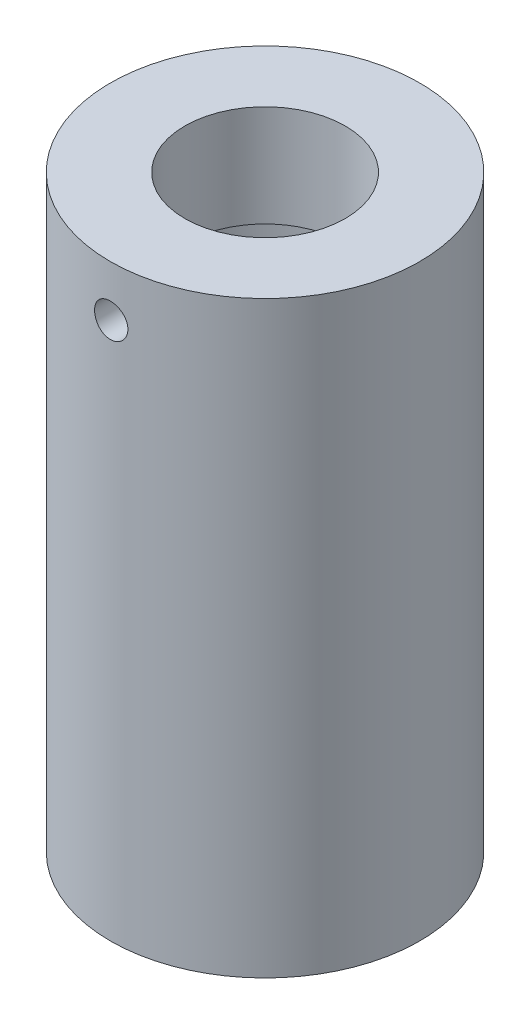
ISO-10303-21;
HEADER;
FILE_DESCRIPTION(('STEP AP214'),'2;1');
FILE_NAME('part.step','',(''),(''),'','','');
FILE_SCHEMA(('AUTOMOTIVE_DESIGN { 1 0 10303 214 1 1 1 1 }'));
ENDSEC;
DATA;
#1=APPLICATION_CONTEXT('core data for automotive mechanical design processes');
#2=APPLICATION_PROTOCOL_DEFINITION('international standard','automotive_design',2000,#1);
#3=PRODUCT_CONTEXT('',#1,'mechanical');
#4=PRODUCT('Part','Part','',(#3));
#5=PRODUCT_RELATED_PRODUCT_CATEGORY('part','',(#4));
#6=PRODUCT_DEFINITION_FORMATION('','',#4);
#7=PRODUCT_DEFINITION_CONTEXT('part definition',#1,'design');
#8=PRODUCT_DEFINITION('design','',#6,#7);
#9=PRODUCT_DEFINITION_SHAPE('','',#8);
#10=(LENGTH_UNIT() NAMED_UNIT(*) SI_UNIT(.MILLI.,.METRE.));
#11=(NAMED_UNIT(*) PLANE_ANGLE_UNIT() SI_UNIT($,.RADIAN.));
#12=(NAMED_UNIT(*) SI_UNIT($,.STERADIAN.) SOLID_ANGLE_UNIT());
#13=UNCERTAINTY_MEASURE_WITH_UNIT(LENGTH_MEASURE(1.E-05),#10,'distance_accuracy_value','');
#14=(GEOMETRIC_REPRESENTATION_CONTEXT(3) GLOBAL_UNCERTAINTY_ASSIGNED_CONTEXT((#13)) GLOBAL_UNIT_ASSIGNED_CONTEXT((#10,
#11,#12)) REPRESENTATION_CONTEXT('',''));
#15=CARTESIAN_POINT('',(0.,0.,0.));
#16=DIRECTION('',(0.,0.,1.));
#17=DIRECTION('',(1.,0.,0.));
#18=AXIS2_PLACEMENT_3D('',#15,#16,#17);
#19=CARTESIAN_POINT('',(0.,93.98,0.));
#20=DIRECTION('',(0.,1.,0.));
#21=DIRECTION('',(0.,0.,1.));
#22=AXIS2_PLACEMENT_3D('',#19,#20,#21);
#23=CYLINDRICAL_SURFACE('',#22,18.8595);
#24=CARTESIAN_POINT('',(0.,71.7296,0.));
#25=DIRECTION('',(0.,1.,0.));
#26=DIRECTION('',(0.,0.,1.));
#27=AXIS2_PLACEMENT_3D('',#24,#25,#26);
#28=CIRCLE('',#27,18.8595);
#29=CARTESIAN_POINT('',(0.,71.7296,18.8595));
#30=VERTEX_POINT('',#29);
#31=EDGE_CURVE('E10',#30,#30,#28,.T.);
#32=ORIENTED_EDGE('',*,*,#31,.F.);
#33=EDGE_LOOP('',(#32));
#34=FACE_BOUND('',#33,.T.);
#35=CARTESIAN_POINT('',(0.,0.,0.));
#36=DIRECTION('',(0.,1.,0.));
#37=DIRECTION('',(0.,0.,1.));
#38=AXIS2_PLACEMENT_3D('',#35,#36,#37);
#39=CIRCLE('',#38,18.8595);
#40=CARTESIAN_POINT('',(0.,0.,18.8595));
#41=VERTEX_POINT('',#40);
#42=EDGE_CURVE('E35',#41,#41,#39,.T.);
#43=ORIENTED_EDGE('',*,*,#42,.T.);
#44=EDGE_LOOP('',(#43));
#45=FACE_BOUND('',#44,.T.);
#46=CARTESIAN_POINT('',(-2.032,65.532,18.7497124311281));
#47=CARTESIAN_POINT('',(-2.03199509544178,65.418217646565,18.7497138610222));
#48=CARTESIAN_POINT('',(-2.02241088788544,65.3043612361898,18.7507593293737));
#49=CARTESIAN_POINT('',(-1.98432430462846,65.0798085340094,18.7548273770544));
#50=CARTESIAN_POINT('',(-1.95580138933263,64.9691158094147,18.7578521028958));
#51=CARTESIAN_POINT('',(-1.88068058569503,64.7541746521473,18.7655321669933));
#52=CARTESIAN_POINT('',(-1.83409402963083,64.6499222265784,18.7701864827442));
#53=CARTESIAN_POINT('',(-1.72419089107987,64.4507376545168,18.7806000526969));
#54=CARTESIAN_POINT('',(-1.66087749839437,64.3558037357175,18.7863590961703));
#55=CARTESIAN_POINT('',(-1.51903275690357,64.1775309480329,18.7983602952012));
#56=CARTESIAN_POINT('',(-1.44044540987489,64.0942367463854,18.8046041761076));
#57=CARTESIAN_POINT('',(-1.27040356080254,63.9419928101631,18.8168559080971));
#58=CARTESIAN_POINT('',(-1.17894845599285,63.8730437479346,18.8228637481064));
#59=CARTESIAN_POINT('',(-0.985491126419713,63.7512909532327,18.8339837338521));
#60=CARTESIAN_POINT('',(-0.883463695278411,63.6985270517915,18.8390936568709));
#61=CARTESIAN_POINT('',(-0.671932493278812,63.6108972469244,18.8478232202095));
#62=CARTESIAN_POINT('',(-0.56242893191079,63.5760308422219,18.8514429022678));
#63=CARTESIAN_POINT('',(-0.339507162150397,63.5253175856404,18.8567720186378));
#64=CARTESIAN_POINT('',(-0.226105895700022,63.509397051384,18.8584888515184));
#65=CARTESIAN_POINT('',(0.00177107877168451,63.496799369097,18.8598440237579));
#66=CARTESIAN_POINT('',(0.116246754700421,63.5001216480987,18.8594824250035));
#67=CARTESIAN_POINT('',(0.342522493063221,63.5258556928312,18.8567275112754));
#68=CARTESIAN_POINT('',(0.454331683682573,63.5481882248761,18.8543426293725));
#69=CARTESIAN_POINT('',(0.672605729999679,63.6111852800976,18.8478187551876));
#70=CARTESIAN_POINT('',(0.779070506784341,63.6518500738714,18.8436797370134));
#71=CARTESIAN_POINT('',(0.983882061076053,63.7504434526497,18.8340983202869));
#72=CARTESIAN_POINT('',(1.08221193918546,63.8084068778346,18.8286532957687));
#73=CARTESIAN_POINT('',(1.26777808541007,63.9399268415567,18.8170703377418));
#74=CARTESIAN_POINT('',(1.3550139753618,64.0134839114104,18.8109323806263));
#75=CARTESIAN_POINT('',(1.5163803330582,64.1745482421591,18.7986150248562));
#76=CARTESIAN_POINT('',(1.59044197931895,64.2621244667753,18.7924355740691));
#77=CARTESIAN_POINT('',(1.72282410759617,64.4485026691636,18.7807627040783));
#78=CARTESIAN_POINT('',(1.78114456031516,64.5473046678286,18.7752692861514));
#79=CARTESIAN_POINT('',(1.88038967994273,64.7533850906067,18.7655901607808));
#80=CARTESIAN_POINT('',(1.92130973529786,64.8606657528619,18.7614048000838));
#81=CARTESIAN_POINT('',(1.98453615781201,65.080630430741,18.7548227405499));
#82=CARTESIAN_POINT('',(2.00684318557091,65.1933142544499,18.7524259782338));
#83=CARTESIAN_POINT('',(2.03212106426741,65.4202813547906,18.7497036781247));
#84=CARTESIAN_POINT('',(2.03518835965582,65.5345537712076,18.749367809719));
#85=CARTESIAN_POINT('',(2.02215332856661,65.761985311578,18.7507780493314));
#86=CARTESIAN_POINT('',(2.00605130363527,65.8751444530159,18.7525241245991));
#87=CARTESIAN_POINT('',(1.95521554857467,66.0968538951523,18.7578921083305));
#88=CARTESIAN_POINT('',(1.92052773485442,66.2054148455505,18.7615093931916));
#89=CARTESIAN_POINT('',(1.83355204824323,66.4151779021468,18.7702084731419));
#90=CARTESIAN_POINT('',(1.78126370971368,66.5163798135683,18.7752903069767));
#91=CARTESIAN_POINT('',(1.66033092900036,66.7089907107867,18.786370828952));
#92=CARTESIAN_POINT('',(1.59162276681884,66.8003594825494,18.7923730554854));
#93=CARTESIAN_POINT('',(1.43989168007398,66.970301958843,18.8046066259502));
#94=CARTESIAN_POINT('',(1.35686834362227,67.0488752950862,18.8108379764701));
#95=CARTESIAN_POINT('',(1.17844439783,67.1913308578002,18.8228590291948));
#96=CARTESIAN_POINT('',(1.0829932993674,67.2551500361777,18.8286467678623));
#97=CARTESIAN_POINT('',(0.882671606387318,67.3658511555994,18.8390996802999));
#98=CARTESIAN_POINT('',(0.777801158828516,67.4127333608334,18.8437648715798));
#99=CARTESIAN_POINT('',(0.561834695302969,67.4881236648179,18.8514382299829));
#100=CARTESIAN_POINT('',(0.450751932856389,67.5166693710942,18.8544497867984));
#101=CARTESIAN_POINT('',(0.225335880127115,67.5546990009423,18.858490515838));
#102=CARTESIAN_POINT('',(0.111002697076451,67.5641835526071,18.8595197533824));
#103=CARTESIAN_POINT('',(-0.117050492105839,67.5638119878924,18.8594797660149));
#104=CARTESIAN_POINT('',(-0.230770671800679,67.5540535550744,18.858421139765));
#105=CARTESIAN_POINT('',(-0.454945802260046,67.515678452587,18.8543453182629));
#106=CARTESIAN_POINT('',(-0.5654007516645,67.4870617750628,18.8513281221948));
#107=CARTESIAN_POINT('',(-0.779905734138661,67.4118106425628,18.8436730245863));
#108=CARTESIAN_POINT('',(-0.883956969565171,67.3651795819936,18.8390354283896));
#109=CARTESIAN_POINT('',(-1.08277156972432,67.2552336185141,18.8286554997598));
#110=CARTESIAN_POINT('',(-1.17753494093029,67.1919187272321,18.8229131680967));
#111=CARTESIAN_POINT('',(-1.3555841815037,67.0500371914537,18.8109315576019));
#112=CARTESIAN_POINT('',(-1.4388119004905,66.9713977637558,18.8046899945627));
#113=CARTESIAN_POINT('',(-1.5909313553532,66.8012461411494,18.7924324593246));
#114=CARTESIAN_POINT('',(-1.65981966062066,66.7097308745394,18.7864165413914));
#115=CARTESIAN_POINT('',(-1.78146770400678,66.5161288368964,18.7752727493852));
#116=CARTESIAN_POINT('',(-1.8341799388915,66.4140120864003,18.7701475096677));
#117=CARTESIAN_POINT('',(-1.92163712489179,66.2023842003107,18.7613965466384));
#118=CARTESIAN_POINT('',(-1.95640213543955,66.0928814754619,18.7577691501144));
#119=CARTESIAN_POINT('',(-1.99840706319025,65.9076444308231,18.7533297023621));
#120=CARTESIAN_POINT('',(-2.01098694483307,65.833090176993,18.7519797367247));
#121=CARTESIAN_POINT('',(-2.02778501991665,65.683034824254,18.7501706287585));
#122=CARTESIAN_POINT('',(-2.03200325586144,65.60753373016,18.7497114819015));
#123=CARTESIAN_POINT('',(-2.032,65.532,18.7497124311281));
#124=B_SPLINE_CURVE_WITH_KNOTS('',3,(#46,#47,#48,#49,#50,#51,#52,#53,#54,#55,#56,#57,#58,#59,
#60,#61,#62,#63,#64,#65,#66,#67,#68,#69,#70,#71,#72,#73,#74,#75,#76,#77,#78,#79,#80,#81,#82,#83,
#84,#85,#86,#87,#88,#89,#90,#91,#92,#93,#94,#95,#96,#97,#98,#99,#100,#101,#102,#103,#104,#105,
#106,#107,#108,#109,#110,#111,#112,#113,#114,#115,#116,#117,#118,#119,#120,#121,#122,#123),
.UNSPECIFIED.,.T.,.F.,(4,2,2,2,2,2,2,2,2,2,2,2,2,2,2,2,2,2,2,2,2,2,2,2,2,2,2,2,2,2,2,2,2,2,2,2,
2,2,4),(0.,0.341071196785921,0.682512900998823,1.02374074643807,1.36490356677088,
1.70734161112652,2.04979570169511,2.39308591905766,2.73636652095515,3.0783076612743,
3.42023862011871,3.7607513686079,4.10126914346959,4.4424774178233,4.78369731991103,
5.12665048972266,5.46960429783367,5.81264894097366,6.15568140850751,6.49699294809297,
6.83829911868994,7.17876595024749,7.51924178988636,7.8610609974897,8.20289004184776,
8.54615386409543,8.88941233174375,9.23196452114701,9.57450542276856,9.91531195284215,
10.2561186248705,10.5968611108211,10.9376033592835,11.280005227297,11.6224889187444,
11.9659689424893,12.3090642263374,12.5354834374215,12.7619014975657),.UNSPECIFIED.);
#125=CARTESIAN_POINT('',(-2.032,65.532,18.7497124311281));
#126=VERTEX_POINT('',#125);
#127=EDGE_CURVE('E54',#126,#126,#124,.T.);
#128=ORIENTED_EDGE('',*,*,#127,.F.);
#129=EDGE_LOOP('',(#128));
#130=FACE_BOUND('',#129,.T.);
#131=ADVANCED_FACE('F28',(#34,#45,#130),#23,.T.);
#132=CARTESIAN_POINT('',(0.,93.98,0.));
#133=DIRECTION('',(0.,1.,0.));
#134=DIRECTION('',(0.,0.,1.));
#135=AXIS2_PLACEMENT_3D('',#132,#133,#134);
#136=CYLINDRICAL_SURFACE('',#135,9.779);
#137=CARTESIAN_POINT('',(0.,59.3598,0.));
#138=DIRECTION('',(0.,1.,0.));
#139=DIRECTION('',(0.,0.,1.));
#140=AXIS2_PLACEMENT_3D('',#137,#138,#139);
#141=CIRCLE('',#140,9.77899999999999);
#142=CARTESIAN_POINT('',(0.,59.3598,9.77899999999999));
#143=VERTEX_POINT('',#142);
#144=EDGE_CURVE('E48',#143,#143,#141,.T.);
#145=ORIENTED_EDGE('',*,*,#144,.F.);
#146=EDGE_LOOP('',(#145));
#147=FACE_BOUND('',#146,.T.);
#148=CARTESIAN_POINT('',(0.,71.7296,0.));
#149=DIRECTION('',(0.,1.,0.));
#150=DIRECTION('',(0.,0.,1.));
#151=AXIS2_PLACEMENT_3D('',#148,#149,#150);
#152=CIRCLE('',#151,9.779);
#153=CARTESIAN_POINT('',(0.,71.7296,9.779));
#154=VERTEX_POINT('',#153);
#155=EDGE_CURVE('E51',#154,#154,#152,.T.);
#156=ORIENTED_EDGE('',*,*,#155,.T.);
#157=EDGE_LOOP('',(#156));
#158=FACE_BOUND('',#157,.T.);
#159=CARTESIAN_POINT('',(-2.032,65.532,9.56555366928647));
#160=CARTESIAN_POINT('',(-2.03199594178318,65.6448083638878,9.56555593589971));
#161=CARTESIAN_POINT('',(-2.02257408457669,65.7576668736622,9.56757093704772));
#162=CARTESIAN_POINT('',(-1.98517097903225,65.980184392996,9.57540018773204));
#163=CARTESIAN_POINT('',(-1.95717546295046,66.0898408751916,9.58121735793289));
#164=CARTESIAN_POINT('',(-1.88353631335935,66.3027030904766,9.59596431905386));
#165=CARTESIAN_POINT('',(-1.83791096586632,66.4059153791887,9.60489088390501));
#166=CARTESIAN_POINT('',(-1.73035830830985,66.6032196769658,9.62484698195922));
#167=CARTESIAN_POINT('',(-1.66843167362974,66.6973120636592,9.63587642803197));
#168=CARTESIAN_POINT('',(-1.5290272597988,66.8751445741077,9.65898353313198));
#169=CARTESIAN_POINT('',(-1.4513481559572,66.9587253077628,9.67107347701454));
#170=CARTESIAN_POINT('',(-1.28307866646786,67.1117686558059,9.69483145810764));
#171=CARTESIAN_POINT('',(-1.19248733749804,67.1812302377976,9.70649946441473));
#172=CARTESIAN_POINT('',(-0.999904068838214,67.3046869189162,9.72823193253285));
#173=CARTESIAN_POINT('',(-0.897812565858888,67.3585297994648,9.73828021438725));
#174=CARTESIAN_POINT('',(-0.685787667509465,67.4482373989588,9.75550275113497));
#175=CARTESIAN_POINT('',(-0.575855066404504,67.4841039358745,9.76267729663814));
#176=CARTESIAN_POINT('',(-0.352924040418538,67.5363424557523,9.77325718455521));
#177=CARTESIAN_POINT('',(-0.239991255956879,67.5529838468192,9.77671456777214));
#178=CARTESIAN_POINT('',(-0.0128873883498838,67.5671409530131,9.77965054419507));
#179=CARTESIAN_POINT('',(0.101283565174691,67.5646586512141,9.77912954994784));
#180=CARTESIAN_POINT('',(0.325769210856,67.5408416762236,9.77420757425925));
#181=CARTESIAN_POINT('',(0.436116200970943,67.5197972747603,9.76986633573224));
#182=CARTESIAN_POINT('',(0.651677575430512,67.4599147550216,9.75785930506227));
#183=CARTESIAN_POINT('',(0.756891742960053,67.4210758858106,9.75019337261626));
#184=CARTESIAN_POINT('',(0.960019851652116,67.3264429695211,9.73230080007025));
#185=CARTESIAN_POINT('',(1.05787996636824,67.2705367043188,9.72205729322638));
#186=CARTESIAN_POINT('',(1.2429366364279,67.1434392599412,9.70013637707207));
#187=CARTESIAN_POINT('',(1.33013187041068,67.0722461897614,9.68845879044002));
#188=CARTESIAN_POINT('',(1.49310784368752,66.9150084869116,9.66469816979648));
#189=CARTESIAN_POINT('',(1.56864316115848,66.8287097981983,9.65261164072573));
#190=CARTESIAN_POINT('',(1.70421173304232,66.6445466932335,9.62960256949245));
#191=CARTESIAN_POINT('',(1.7642446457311,66.5466820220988,9.61868005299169));
#192=CARTESIAN_POINT('',(1.8671987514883,66.3417945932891,9.59922781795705));
#193=CARTESIAN_POINT('',(1.91007752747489,66.2347499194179,9.59070404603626));
#194=CARTESIAN_POINT('',(1.97716705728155,66.0147565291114,9.5770995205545));
#195=CARTESIAN_POINT('',(2.00138045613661,65.9018086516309,9.57201827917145));
#196=CARTESIAN_POINT('',(2.03007949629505,65.6754467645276,9.5659725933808));
#197=CARTESIAN_POINT('',(2.03492073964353,65.56207977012,9.56493395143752));
#198=CARTESIAN_POINT('',(2.02569731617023,65.3361583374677,9.56689149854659));
#199=CARTESIAN_POINT('',(2.01163381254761,65.2236038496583,9.5698874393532));
#200=CARTESIAN_POINT('',(1.96530748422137,65.0037150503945,9.57950686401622));
#201=CARTESIAN_POINT('',(1.93323703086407,64.8963383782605,9.58609198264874));
#202=CARTESIAN_POINT('',(1.85201390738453,64.6884823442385,9.60211375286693));
#203=CARTESIAN_POINT('',(1.80285973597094,64.5880035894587,9.61155065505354));
#204=CARTESIAN_POINT('',(1.68806828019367,64.3952465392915,9.63237789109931));
#205=CARTESIAN_POINT('',(1.62220988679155,64.3031027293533,9.64379372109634));
#206=CARTESIAN_POINT('',(1.47617198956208,64.1310444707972,9.66722369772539));
#207=CARTESIAN_POINT('',(1.39599088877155,64.051131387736,9.67923791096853));
#208=CARTESIAN_POINT('',(1.22198203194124,63.9044418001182,9.70275330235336));
#209=CARTESIAN_POINT('',(1.12794902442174,63.8379065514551,9.71424258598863));
#210=CARTESIAN_POINT('',(0.929833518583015,63.7215782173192,9.73520200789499));
#211=CARTESIAN_POINT('',(0.825751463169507,63.6717843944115,9.74467223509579));
#212=CARTESIAN_POINT('',(0.611105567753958,63.5906977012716,9.7604759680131));
#213=CARTESIAN_POINT('',(0.500584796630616,63.5592946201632,9.7668281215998));
#214=CARTESIAN_POINT('',(0.275690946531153,63.51553353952,9.77576024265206));
#215=CARTESIAN_POINT('',(0.161318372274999,63.5031730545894,9.77834070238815));
#216=CARTESIAN_POINT('',(-0.0657338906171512,63.4979506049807,9.77942583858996));
#217=CARTESIAN_POINT('',(-0.178405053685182,63.5047269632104,9.77800611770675));
#218=CARTESIAN_POINT('',(-0.400965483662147,63.53678303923,9.77141059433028));
#219=CARTESIAN_POINT('',(-0.510854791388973,63.5620624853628,9.76623484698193));
#220=CARTESIAN_POINT('',(-0.724484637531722,63.6302411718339,9.75271237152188));
#221=CARTESIAN_POINT('',(-0.828240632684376,63.6730937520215,9.74437404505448));
#222=CARTESIAN_POINT('',(-1.02714020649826,63.7751548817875,9.72542117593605));
#223=CARTESIAN_POINT('',(-1.1222830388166,63.834364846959,9.71480643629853));
#224=CARTESIAN_POINT('',(-1.30303423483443,63.9686635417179,9.69223359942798));
#225=CARTESIAN_POINT('',(-1.38844916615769,64.0440092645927,9.68025543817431));
#226=CARTESIAN_POINT('',(-1.54554715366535,64.2079164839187,9.65642032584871));
#227=CARTESIAN_POINT('',(-1.61722693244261,64.2964811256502,9.64456340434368));
#228=CARTESIAN_POINT('',(-1.74562860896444,64.4855678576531,9.62215835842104));
#229=CARTESIAN_POINT('',(-1.80216394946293,64.5862187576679,9.61162733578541));
#230=CARTESIAN_POINT('',(-1.89742884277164,64.7957856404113,9.59327769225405));
#231=CARTESIAN_POINT('',(-1.93617411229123,64.9046942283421,9.58545667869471));
#232=CARTESIAN_POINT('',(-1.98748603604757,65.1001635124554,9.57492738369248));
#233=CARTESIAN_POINT('',(-2.00414804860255,65.1856305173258,9.57143464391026));
#234=CARTESIAN_POINT('',(-2.02640637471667,65.3580551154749,9.56674695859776));
#235=CARTESIAN_POINT('',(-2.03200312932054,65.4450126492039,9.56555192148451));
#236=CARTESIAN_POINT('',(-2.032,65.532,9.56555366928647));
#237=B_SPLINE_CURVE_WITH_KNOTS('',3,(#159,#160,#161,#162,#163,#164,#165,#166,#167,#168,#169,
#170,#171,#172,#173,#174,#175,#176,#177,#178,#179,#180,#181,#182,#183,#184,#185,#186,#187,#188,
#189,#190,#191,#192,#193,#194,#195,#196,#197,#198,#199,#200,#201,#202,#203,#204,#205,#206,#207,
#208,#209,#210,#211,#212,#213,#214,#215,#216,#217,#218,#219,#220,#221,#222,#223,#224,#225,#226,
#227,#228,#229,#230,#231,#232,#233,#234,#235,#236),.UNSPECIFIED.,.T.,.F.,(4,2,2,2,2,2,2,2,2,2,2,
2,2,2,2,2,2,2,2,2,2,2,2,2,2,2,2,2,2,2,2,2,2,2,2,2,2,2,4),(0.,0.33810647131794,0.676472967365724,
1.01448944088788,1.35249191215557,1.69512250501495,2.03777814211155,2.38366895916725,
2.72952478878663,3.07047288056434,3.41138561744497,3.74705988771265,4.08274832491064,
4.42069326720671,4.75868003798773,5.10302121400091,5.4473699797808,5.79256503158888,
6.13771115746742,6.47649177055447,6.81525153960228,7.15045931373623,7.48569655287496,
7.82562666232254,8.16559469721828,8.51123133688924,8.85685274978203,9.20038117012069,
9.54386475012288,9.88090033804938,10.217930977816,10.5540724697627,10.8902430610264,
11.2322296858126,11.5742978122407,11.9204038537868,12.2662035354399,12.52693028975,
12.7876466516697),.UNSPECIFIED.);
#238=CARTESIAN_POINT('',(-2.032,65.532,9.56555366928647));
#239=VERTEX_POINT('',#238);
#240=EDGE_CURVE('E61',#239,#239,#237,.T.);
#241=ORIENTED_EDGE('',*,*,#240,.F.);
#242=EDGE_LOOP('',(#241));
#243=FACE_BOUND('',#242,.T.);
#244=ADVANCED_FACE('F73',(#147,#158,#243),#136,.F.);
#245=CARTESIAN_POINT('',(-9.779,71.7296,0.));
#246=DIRECTION('',(0.,1.,0.));
#247=DIRECTION('',(0.,0.,1.));
#248=AXIS2_PLACEMENT_3D('',#245,#246,#247);
#249=PLANE('',#248);
#250=ORIENTED_EDGE('',*,*,#31,.T.);
#251=EDGE_LOOP('',(#250));
#252=FACE_BOUND('',#251,.T.);
#253=ORIENTED_EDGE('',*,*,#155,.F.);
#254=EDGE_LOOP('',(#253));
#255=FACE_BOUND('',#254,.T.);
#256=ADVANCED_FACE('F30',(#252,#255),#249,.T.);
#257=CARTESIAN_POINT('',(-18.8595,0.,0.));
#258=DIRECTION('',(0.,-1.,0.));
#259=DIRECTION('',(0.,0.,-1.));
#260=AXIS2_PLACEMENT_3D('',#257,#258,#259);
#261=PLANE('',#260);
#262=CARTESIAN_POINT('',(0.,0.,0.));
#263=DIRECTION('',(0.,1.,0.));
#264=DIRECTION('',(0.,0.,1.));
#265=AXIS2_PLACEMENT_3D('',#262,#263,#264);
#266=CIRCLE('',#265,16.49984);
#267=CARTESIAN_POINT('',(0.,0.,16.49984));
#268=VERTEX_POINT('',#267);
#269=EDGE_CURVE('E39',#268,#268,#266,.T.);
#270=ORIENTED_EDGE('',*,*,#269,.T.);
#271=EDGE_LOOP('',(#270));
#272=FACE_BOUND('',#271,.T.);
#273=ORIENTED_EDGE('',*,*,#42,.F.);
#274=EDGE_LOOP('',(#273));
#275=FACE_BOUND('',#274,.T.);
#276=ADVANCED_FACE('F84',(#272,#275),#261,.T.);
#277=CARTESIAN_POINT('',(0.,93.98,0.));
#278=DIRECTION('',(0.,1.,0.));
#279=DIRECTION('',(0.,0.,1.));
#280=AXIS2_PLACEMENT_3D('',#277,#278,#279);
#281=CYLINDRICAL_SURFACE('',#280,16.49984);
#282=CARTESIAN_POINT('',(0.,59.3598,0.));
#283=DIRECTION('',(0.,1.,0.));
#284=DIRECTION('',(0.,0.,1.));
#285=AXIS2_PLACEMENT_3D('',#282,#283,#284);
#286=CIRCLE('',#285,16.49984);
#287=CARTESIAN_POINT('',(0.,59.3598,16.49984));
#288=VERTEX_POINT('',#287);
#289=EDGE_CURVE('E43',#288,#288,#286,.T.);
#290=ORIENTED_EDGE('',*,*,#289,.T.);
#291=EDGE_LOOP('',(#290));
#292=FACE_BOUND('',#291,.T.);
#293=ORIENTED_EDGE('',*,*,#269,.F.);
#294=EDGE_LOOP('',(#293));
#295=FACE_BOUND('',#294,.T.);
#296=ADVANCED_FACE('F80',(#292,#295),#281,.F.);
#297=CARTESIAN_POINT('',(-9.77899999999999,59.3598,0.));
#298=DIRECTION('',(0.,-1.,0.));
#299=DIRECTION('',(0.,0.,-1.));
#300=AXIS2_PLACEMENT_3D('',#297,#298,#299);
#301=PLANE('',#300);
#302=ORIENTED_EDGE('',*,*,#144,.T.);
#303=EDGE_LOOP('',(#302));
#304=FACE_BOUND('',#303,.T.);
#305=ORIENTED_EDGE('',*,*,#289,.F.);
#306=EDGE_LOOP('',(#305));
#307=FACE_BOUND('',#306,.T.);
#308=ADVANCED_FACE('F71',(#304,#307),#301,.T.);
#309=CARTESIAN_POINT('',(0.,65.532,18.8605));
#310=DIRECTION('',(0.,0.,-1.));
#311=DIRECTION('',(-1.,0.,0.));
#312=AXIS2_PLACEMENT_3D('',#309,#310,#311);
#313=CYLINDRICAL_SURFACE('',#312,2.032);
#314=ORIENTED_EDGE('',*,*,#127,.T.);
#315=EDGE_LOOP('',(#314));
#316=FACE_BOUND('',#315,.T.);
#317=ORIENTED_EDGE('',*,*,#240,.T.);
#318=EDGE_LOOP('',(#317));
#319=FACE_BOUND('',#318,.T.);
#320=ADVANCED_FACE('F65',(#316,#319),#313,.F.);
#321=CLOSED_SHELL('',(#131,#244,#256,#276,#296,#308,#320));
#322=MANIFOLD_SOLID_BREP('B2',#321);
#323=ADVANCED_BREP_SHAPE_REPRESENTATION('',(#18,#322),#14);
#324=SHAPE_DEFINITION_REPRESENTATION(#9,#323);
ENDSEC;
END-ISO-10303-21;
